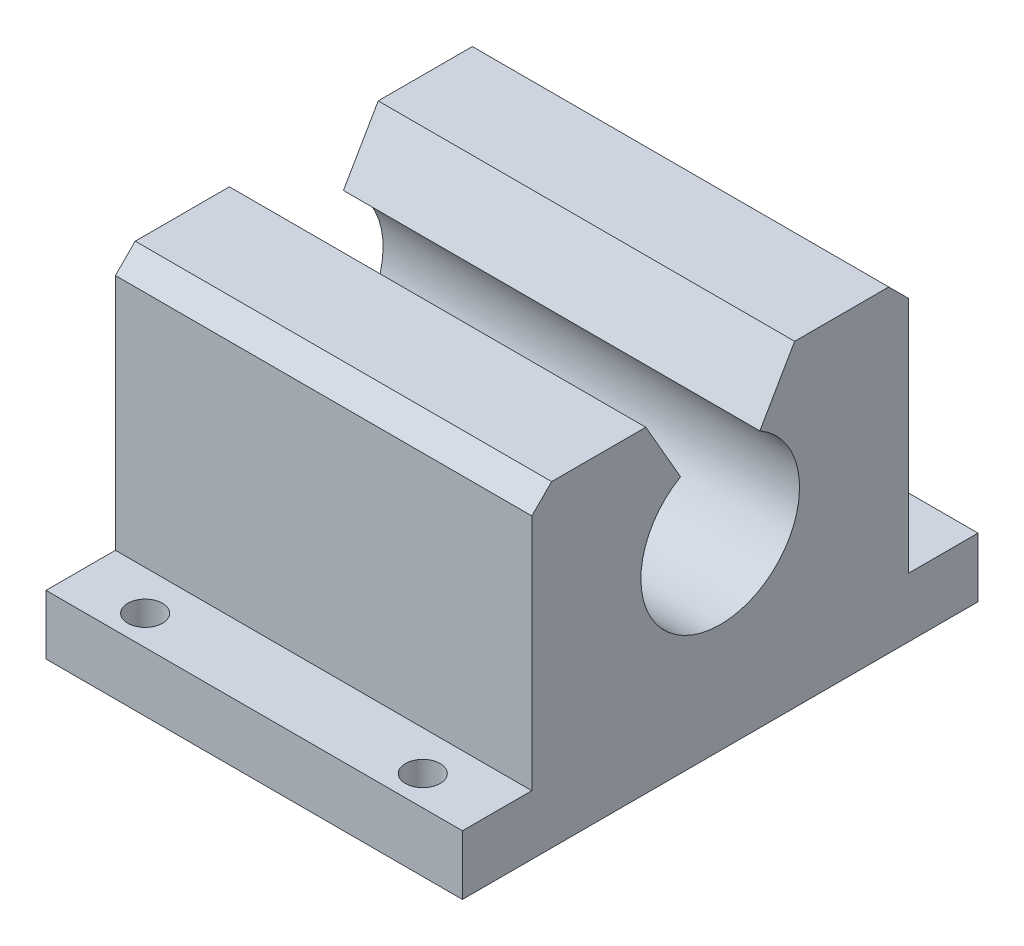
ISO-10303-21;
HEADER;
FILE_DESCRIPTION(('STEP AP214'),'2;1');
FILE_NAME('part.step','',(''),(''),'','','');
FILE_SCHEMA(('AUTOMOTIVE_DESIGN { 1 0 10303 214 1 1 1 1 }'));
ENDSEC;
DATA;
#1=APPLICATION_CONTEXT('core data for automotive mechanical design processes');
#2=APPLICATION_PROTOCOL_DEFINITION('international standard','automotive_design',2000,#1);
#3=PRODUCT_CONTEXT('',#1,'mechanical');
#4=PRODUCT('Part','Part','',(#3));
#5=PRODUCT_RELATED_PRODUCT_CATEGORY('part','',(#4));
#6=PRODUCT_DEFINITION_FORMATION('','',#4);
#7=PRODUCT_DEFINITION_CONTEXT('part definition',#1,'design');
#8=PRODUCT_DEFINITION('design','',#6,#7);
#9=PRODUCT_DEFINITION_SHAPE('','',#8);
#10=(LENGTH_UNIT() NAMED_UNIT(*) SI_UNIT(.MILLI.,.METRE.));
#11=(NAMED_UNIT(*) PLANE_ANGLE_UNIT() SI_UNIT($,.RADIAN.));
#12=(NAMED_UNIT(*) SI_UNIT($,.STERADIAN.) SOLID_ANGLE_UNIT());
#13=UNCERTAINTY_MEASURE_WITH_UNIT(LENGTH_MEASURE(1.E-05),#10,'distance_accuracy_value','');
#14=(GEOMETRIC_REPRESENTATION_CONTEXT(3) GLOBAL_UNCERTAINTY_ASSIGNED_CONTEXT((#13)) GLOBAL_UNIT_ASSIGNED_CONTEXT((#10,
#11,#12)) REPRESENTATION_CONTEXT('',''));
#15=CARTESIAN_POINT('',(0.,0.,0.));
#16=DIRECTION('',(0.,0.,1.));
#17=DIRECTION('',(1.,0.,0.));
#18=AXIS2_PLACEMENT_3D('',#15,#16,#17);
#19=CARTESIAN_POINT('',(66.675,50.8,30.1625));
#20=DIRECTION('',(0.,1.,0.));
#21=DIRECTION('',(0.,0.,1.));
#22=AXIS2_PLACEMENT_3D('',#19,#20,#21);
#23=PLANE('',#22);
#24=DIRECTION('',(0.,0.,-1.));
#25=VECTOR('',#24,1.);
#26=CARTESIAN_POINT('',(66.675,50.8,30.1625));
#27=LINE('',#26,#25);
#28=CARTESIAN_POINT('',(66.675,50.8,-11.9150661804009));
#29=VERTEX_POINT('',#28);
#30=CARTESIAN_POINT('',(66.675,50.8,-26.9874999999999));
#31=VERTEX_POINT('',#30);
#32=EDGE_CURVE('E146',#29,#31,#27,.T.);
#33=ORIENTED_EDGE('',*,*,#32,.T.);
#34=DIRECTION('',(-1.,0.,0.));
#35=VECTOR('',#34,1.);
#36=CARTESIAN_POINT('',(0.,50.8,-26.9874999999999));
#37=LINE('',#36,#35);
#38=CARTESIAN_POINT('',(0.,50.8,-26.9874999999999));
#39=VERTEX_POINT('',#38);
#40=EDGE_CURVE('E38',#31,#39,#37,.T.);
#41=ORIENTED_EDGE('',*,*,#40,.T.);
#42=DIRECTION('',(0.,0.,-1.));
#43=VECTOR('',#42,1.);
#44=CARTESIAN_POINT('',(0.,50.8,30.1625));
#45=LINE('',#44,#43);
#46=CARTESIAN_POINT('',(0.,50.8,-11.9150661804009));
#47=VERTEX_POINT('',#46);
#48=EDGE_CURVE('E149',#47,#39,#45,.T.);
#49=ORIENTED_EDGE('',*,*,#48,.F.);
#50=DIRECTION('',(1.,0.,0.));
#51=VECTOR('',#50,1.);
#52=CARTESIAN_POINT('',(0.,50.8,-11.9150661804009));
#53=LINE('',#52,#51);
#54=EDGE_CURVE('E134',#47,#29,#53,.T.);
#55=ORIENTED_EDGE('',*,*,#54,.T.);
#56=EDGE_LOOP('',(#33,#41,#49,#55));
#57=FACE_BOUND('',#56,.T.);
#58=ADVANCED_FACE('F30',(#57),#23,.T.);
#59=CARTESIAN_POINT('',(66.675,50.8,-41.275));
#60=DIRECTION('',(-1.,0.,0.));
#61=DIRECTION('',(0.,0.,1.));
#62=AXIS2_PLACEMENT_3D('',#59,#60,#61);
#63=PLANE('',#62);
#64=CARTESIAN_POINT('',(66.675,50.8,26.9875));
#65=VERTEX_POINT('',#64);
#66=CARTESIAN_POINT('',(66.675,50.8,11.9150661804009));
#67=VERTEX_POINT('',#66);
#68=EDGE_CURVE('E155',#65,#67,#27,.T.);
#69=ORIENTED_EDGE('',*,*,#68,.F.);
#70=DIRECTION('',(0.,0.707106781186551,-0.707106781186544));
#71=VECTOR('',#70,1.);
#72=CARTESIAN_POINT('',(66.675,47.6249999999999,30.1625));
#73=LINE('',#72,#71);
#74=CARTESIAN_POINT('',(66.675,47.6249999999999,30.1625));
#75=VERTEX_POINT('',#74);
#76=EDGE_CURVE('E201',#65,#75,#73,.F.);
#77=ORIENTED_EDGE('',*,*,#76,.T.);
#78=DIRECTION('',(0.,1.,0.));
#79=VECTOR('',#78,1.);
#80=CARTESIAN_POINT('',(66.675,9.525,30.1625));
#81=LINE('',#80,#79);
#82=CARTESIAN_POINT('',(66.675,9.525,30.1625));
#83=VERTEX_POINT('',#82);
#84=EDGE_CURVE('E158',#83,#75,#81,.T.);
#85=ORIENTED_EDGE('',*,*,#84,.F.);
#86=DIRECTION('',(0.,0.,-1.));
#87=VECTOR('',#86,1.);
#88=CARTESIAN_POINT('',(66.675,9.525,41.275));
#89=LINE('',#88,#87);
#90=CARTESIAN_POINT('',(66.675,9.525,41.275));
#91=VERTEX_POINT('',#90);
#92=EDGE_CURVE('E165',#91,#83,#89,.T.);
#93=ORIENTED_EDGE('',*,*,#92,.F.);
#94=DIRECTION('',(0.,1.,0.));
#95=VECTOR('',#94,1.);
#96=CARTESIAN_POINT('',(66.675,0.,41.275));
#97=LINE('',#96,#95);
#98=CARTESIAN_POINT('',(66.675,0.,41.275));
#99=VERTEX_POINT('',#98);
#100=EDGE_CURVE('E168',#99,#91,#97,.T.);
#101=ORIENTED_EDGE('',*,*,#100,.F.);
#102=DIRECTION('',(0.,0.,-1.));
#103=VECTOR('',#102,1.);
#104=CARTESIAN_POINT('',(66.675,0.,41.275));
#105=LINE('',#104,#103);
#106=CARTESIAN_POINT('',(66.675,0.,-41.275));
#107=VERTEX_POINT('',#106);
#108=EDGE_CURVE('E171',#99,#107,#105,.T.);
#109=ORIENTED_EDGE('',*,*,#108,.T.);
#110=DIRECTION('',(0.,1.,0.));
#111=VECTOR('',#110,1.);
#112=CARTESIAN_POINT('',(66.675,0.,-41.275));
#113=LINE('',#112,#111);
#114=CARTESIAN_POINT('',(66.675,9.525,-41.275));
#115=VERTEX_POINT('',#114);
#116=EDGE_CURVE('E225',#107,#115,#113,.T.);
#117=ORIENTED_EDGE('',*,*,#116,.T.);
#118=DIRECTION('',(0.,0.,1.));
#119=VECTOR('',#118,1.);
#120=CARTESIAN_POINT('',(66.675,9.525,-41.275));
#121=LINE('',#120,#119);
#122=CARTESIAN_POINT('',(66.675,9.525,-30.1625));
#123=VERTEX_POINT('',#122);
#124=EDGE_CURVE('E159',#115,#123,#121,.T.);
#125=ORIENTED_EDGE('',*,*,#124,.T.);
#126=DIRECTION('',(0.,1.,0.));
#127=VECTOR('',#126,1.);
#128=CARTESIAN_POINT('',(66.675,9.525,-30.1625));
#129=LINE('',#128,#127);
#130=CARTESIAN_POINT('',(66.675,47.625,-30.1625));
#131=VERTEX_POINT('',#130);
#132=EDGE_CURVE('E156',#123,#131,#129,.T.);
#133=ORIENTED_EDGE('',*,*,#132,.T.);
#134=DIRECTION('',(0.,0.707106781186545,0.707106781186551));
#135=VECTOR('',#134,1.);
#136=CARTESIAN_POINT('',(66.675,50.8,-26.9874999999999));
#137=LINE('',#136,#135);
#138=EDGE_CURVE('E45',#131,#31,#137,.T.);
#139=ORIENTED_EDGE('',*,*,#138,.T.);
#140=ORIENTED_EDGE('',*,*,#32,.F.);
#141=DIRECTION('',(0.,-0.866025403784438,0.500000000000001));
#142=VECTOR('',#141,1.);
#143=CARTESIAN_POINT('',(66.675,50.8,-11.9150661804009));
#144=LINE('',#143,#142);
#145=CARTESIAN_POINT('',(66.675,41.1610226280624,-6.35000000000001));
#146=VERTEX_POINT('',#145);
#147=EDGE_CURVE('E131',#29,#146,#144,.T.);
#148=ORIENTED_EDGE('',*,*,#147,.T.);
#149=CARTESIAN_POINT('',(66.675,30.1625,0.));
#150=DIRECTION('',(1.,0.,0.));
#151=DIRECTION('',(0.,0.,-1.));
#152=AXIS2_PLACEMENT_3D('',#149,#150,#151);
#153=CIRCLE('',#152,12.7);
#154=CARTESIAN_POINT('',(66.675,41.1610226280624,6.35000000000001));
#155=VERTEX_POINT('',#154);
#156=EDGE_CURVE('E382',#155,#146,#153,.T.);
#157=ORIENTED_EDGE('',*,*,#156,.F.);
#158=DIRECTION('',(0.,-0.866025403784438,-0.500000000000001));
#159=VECTOR('',#158,1.);
#160=CARTESIAN_POINT('',(66.675,50.8,11.9150661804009));
#161=LINE('',#160,#159);
#162=EDGE_CURVE('E141',#67,#155,#161,.T.);
#163=ORIENTED_EDGE('',*,*,#162,.F.);
#164=EDGE_LOOP('',(#69,#77,#85,#93,#101,#109,#117,#125,#133,#139,#140,#148,#157,#163));
#165=FACE_BOUND('',#164,.T.);
#166=ADVANCED_FACE('F154',(#165),#63,.F.);
#167=CARTESIAN_POINT('',(0.,50.8,-41.275));
#168=DIRECTION('',(-1.,0.,0.));
#169=DIRECTION('',(0.,0.,1.));
#170=AXIS2_PLACEMENT_3D('',#167,#168,#169);
#171=PLANE('',#170);
#172=DIRECTION('',(0.,1.,0.));
#173=VECTOR('',#172,1.);
#174=CARTESIAN_POINT('',(0.,9.525,30.1625));
#175=LINE('',#174,#173);
#176=CARTESIAN_POINT('',(0.,9.525,30.1625));
#177=VERTEX_POINT('',#176);
#178=CARTESIAN_POINT('',(0.,47.6249999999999,30.1625));
#179=VERTEX_POINT('',#178);
#180=EDGE_CURVE('E211',#177,#179,#175,.T.);
#181=ORIENTED_EDGE('',*,*,#180,.T.);
#182=DIRECTION('',(0.,-0.707106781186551,0.707106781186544));
#183=VECTOR('',#182,1.);
#184=CARTESIAN_POINT('',(0.,84.93125,-7.14374999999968));
#185=LINE('',#184,#183);
#186=CARTESIAN_POINT('',(0.,50.8,26.9875));
#187=VERTEX_POINT('',#186);
#188=EDGE_CURVE('E196',#179,#187,#185,.F.);
#189=ORIENTED_EDGE('',*,*,#188,.T.);
#190=CARTESIAN_POINT('',(0.,50.8,11.9150661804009));
#191=VERTEX_POINT('',#190);
#192=EDGE_CURVE('E208',#187,#191,#45,.T.);
#193=ORIENTED_EDGE('',*,*,#192,.T.);
#194=DIRECTION('',(0.,-0.866025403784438,-0.500000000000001));
#195=VECTOR('',#194,1.);
#196=CARTESIAN_POINT('',(0.,50.8,11.9150661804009));
#197=LINE('',#196,#195);
#198=CARTESIAN_POINT('',(0.,41.1610226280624,6.35000000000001));
#199=VERTEX_POINT('',#198);
#200=EDGE_CURVE('E140',#191,#199,#197,.T.);
#201=ORIENTED_EDGE('',*,*,#200,.T.);
#202=CARTESIAN_POINT('',(0.,30.1625,0.));
#203=DIRECTION('',(1.,0.,0.));
#204=DIRECTION('',(0.,0.,-1.));
#205=AXIS2_PLACEMENT_3D('',#202,#203,#204);
#206=CIRCLE('',#205,12.7);
#207=CARTESIAN_POINT('',(0.,41.1610226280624,-6.35000000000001));
#208=VERTEX_POINT('',#207);
#209=EDGE_CURVE('E384',#199,#208,#206,.T.);
#210=ORIENTED_EDGE('',*,*,#209,.T.);
#211=DIRECTION('',(0.,-0.866025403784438,0.500000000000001));
#212=VECTOR('',#211,1.);
#213=CARTESIAN_POINT('',(0.,50.8,-11.9150661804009));
#214=LINE('',#213,#212);
#215=EDGE_CURVE('E151',#47,#208,#214,.T.);
#216=ORIENTED_EDGE('',*,*,#215,.F.);
#217=ORIENTED_EDGE('',*,*,#48,.T.);
#218=DIRECTION('',(0.,-0.707106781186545,-0.707106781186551));
#219=VECTOR('',#218,1.);
#220=CARTESIAN_POINT('',(0.,43.65625,-34.13125));
#221=LINE('',#220,#219);
#222=CARTESIAN_POINT('',(0.,47.625,-30.1625));
#223=VERTEX_POINT('',#222);
#224=EDGE_CURVE('E194',#39,#223,#221,.T.);
#225=ORIENTED_EDGE('',*,*,#224,.T.);
#226=DIRECTION('',(0.,1.,0.));
#227=VECTOR('',#226,1.);
#228=CARTESIAN_POINT('',(0.,9.525,-30.1625));
#229=LINE('',#228,#227);
#230=CARTESIAN_POINT('',(0.,9.525,-30.1625));
#231=VERTEX_POINT('',#230);
#232=EDGE_CURVE('E209',#231,#223,#229,.T.);
#233=ORIENTED_EDGE('',*,*,#232,.F.);
#234=DIRECTION('',(0.,0.,1.));
#235=VECTOR('',#234,1.);
#236=CARTESIAN_POINT('',(0.,9.525,-41.275));
#237=LINE('',#236,#235);
#238=CARTESIAN_POINT('',(0.,9.525,-41.275));
#239=VERTEX_POINT('',#238);
#240=EDGE_CURVE('E212',#239,#231,#237,.T.);
#241=ORIENTED_EDGE('',*,*,#240,.F.);
#242=DIRECTION('',(0.,1.,0.));
#243=VECTOR('',#242,1.);
#244=CARTESIAN_POINT('',(0.,0.,-41.275));
#245=LINE('',#244,#243);
#246=CARTESIAN_POINT('',(0.,0.,-41.275));
#247=VERTEX_POINT('',#246);
#248=EDGE_CURVE('E379',#247,#239,#245,.T.);
#249=ORIENTED_EDGE('',*,*,#248,.F.);
#250=DIRECTION('',(0.,0.,-1.));
#251=VECTOR('',#250,1.);
#252=CARTESIAN_POINT('',(0.,0.,41.275));
#253=LINE('',#252,#251);
#254=CARTESIAN_POINT('',(0.,0.,41.275));
#255=VERTEX_POINT('',#254);
#256=EDGE_CURVE('E223',#255,#247,#253,.T.);
#257=ORIENTED_EDGE('',*,*,#256,.F.);
#258=DIRECTION('',(0.,1.,0.));
#259=VECTOR('',#258,1.);
#260=CARTESIAN_POINT('',(0.,0.,41.275));
#261=LINE('',#260,#259);
#262=CARTESIAN_POINT('',(0.,9.525,41.275));
#263=VERTEX_POINT('',#262);
#264=EDGE_CURVE('E220',#255,#263,#261,.T.);
#265=ORIENTED_EDGE('',*,*,#264,.T.);
#266=DIRECTION('',(0.,0.,-1.));
#267=VECTOR('',#266,1.);
#268=CARTESIAN_POINT('',(0.,9.525,41.275));
#269=LINE('',#268,#267);
#270=EDGE_CURVE('E217',#263,#177,#269,.T.);
#271=ORIENTED_EDGE('',*,*,#270,.T.);
#272=EDGE_LOOP('',(#181,#189,#193,#201,#210,#216,#217,#225,#233,#241,#249,#257,#265,#271));
#273=FACE_BOUND('',#272,.T.);
#274=ADVANCED_FACE('F205',(#273),#171,.T.);
#275=CARTESIAN_POINT('',(66.675,0.,-41.275));
#276=DIRECTION('',(0.,0.,1.));
#277=DIRECTION('',(1.,0.,0.));
#278=AXIS2_PLACEMENT_3D('',#275,#276,#277);
#279=PLANE('',#278);
#280=ORIENTED_EDGE('',*,*,#248,.T.);
#281=DIRECTION('',(-1.,0.,0.));
#282=VECTOR('',#281,1.);
#283=CARTESIAN_POINT('',(66.675,9.525,-41.275));
#284=LINE('',#283,#282);
#285=EDGE_CURVE('E185',#115,#239,#284,.T.);
#286=ORIENTED_EDGE('',*,*,#285,.F.);
#287=ORIENTED_EDGE('',*,*,#116,.F.);
#288=DIRECTION('',(-1.,0.,0.));
#289=VECTOR('',#288,1.);
#290=CARTESIAN_POINT('',(66.675,0.,-41.275));
#291=LINE('',#290,#289);
#292=EDGE_CURVE('E173',#107,#247,#291,.T.);
#293=ORIENTED_EDGE('',*,*,#292,.T.);
#294=EDGE_LOOP('',(#280,#286,#287,#293));
#295=FACE_BOUND('',#294,.T.);
#296=ADVANCED_FACE('F32',(#295),#279,.F.);
#297=CARTESIAN_POINT('',(66.675,9.525,-41.275));
#298=DIRECTION('',(0.,-1.,0.));
#299=DIRECTION('',(0.,0.,-1.));
#300=AXIS2_PLACEMENT_3D('',#297,#298,#299);
#301=PLANE('',#300);
#302=CARTESIAN_POINT('',(11.1125,9.525,-36.5125));
#303=DIRECTION('',(0.,1.,0.));
#304=DIRECTION('',(0.,0.,1.));
#305=AXIS2_PLACEMENT_3D('',#302,#303,#304);
#306=CIRCLE('',#305,2.778125);
#307=CARTESIAN_POINT('',(11.1125,9.525,-33.734375));
#308=VERTEX_POINT('',#307);
#309=EDGE_CURVE('E409',#308,#308,#306,.T.);
#310=ORIENTED_EDGE('',*,*,#309,.F.);
#311=EDGE_LOOP('',(#310));
#312=FACE_BOUND('',#311,.T.);
#313=CARTESIAN_POINT('',(55.5625,9.525,-36.5125));
#314=DIRECTION('',(0.,1.,0.));
#315=DIRECTION('',(0.,0.,1.));
#316=AXIS2_PLACEMENT_3D('',#313,#314,#315);
#317=CIRCLE('',#316,2.778125);
#318=CARTESIAN_POINT('',(55.5625,9.525,-33.734375));
#319=VERTEX_POINT('',#318);
#320=EDGE_CURVE('E397',#319,#319,#317,.T.);
#321=ORIENTED_EDGE('',*,*,#320,.F.);
#322=EDGE_LOOP('',(#321));
#323=FACE_BOUND('',#322,.T.);
#324=ORIENTED_EDGE('',*,*,#240,.T.);
#325=DIRECTION('',(-1.,0.,0.));
#326=VECTOR('',#325,1.);
#327=CARTESIAN_POINT('',(66.675,9.525,-30.1625));
#328=LINE('',#327,#326);
#329=EDGE_CURVE('E182',#123,#231,#328,.T.);
#330=ORIENTED_EDGE('',*,*,#329,.F.);
#331=ORIENTED_EDGE('',*,*,#124,.F.);
#332=ORIENTED_EDGE('',*,*,#285,.T.);
#333=EDGE_LOOP('',(#324,#330,#331,#332));
#334=FACE_BOUND('',#333,.T.);
#335=ADVANCED_FACE('F231',(#312,#323,#334),#301,.F.);
#336=CARTESIAN_POINT('',(66.675,9.525,-30.1625));
#337=DIRECTION('',(0.,0.,1.));
#338=DIRECTION('',(1.,0.,0.));
#339=AXIS2_PLACEMENT_3D('',#336,#337,#338);
#340=PLANE('',#339);
#341=ORIENTED_EDGE('',*,*,#232,.T.);
#342=DIRECTION('',(1.,0.,0.));
#343=VECTOR('',#342,1.);
#344=CARTESIAN_POINT('',(66.675,47.625,-30.1625));
#345=LINE('',#344,#343);
#346=EDGE_CURVE('E11',#223,#131,#345,.T.);
#347=ORIENTED_EDGE('',*,*,#346,.T.);
#348=ORIENTED_EDGE('',*,*,#132,.F.);
#349=ORIENTED_EDGE('',*,*,#329,.T.);
#350=EDGE_LOOP('',(#341,#347,#348,#349));
#351=FACE_BOUND('',#350,.T.);
#352=ADVANCED_FACE('F232',(#351),#340,.F.);
#353=ORIENTED_EDGE('',*,*,#192,.F.);
#354=DIRECTION('',(1.,0.,0.));
#355=VECTOR('',#354,1.);
#356=CARTESIAN_POINT('',(66.675,50.8,26.9875));
#357=LINE('',#356,#355);
#358=EDGE_CURVE('E198',#187,#65,#357,.T.);
#359=ORIENTED_EDGE('',*,*,#358,.T.);
#360=ORIENTED_EDGE('',*,*,#68,.T.);
#361=DIRECTION('',(1.,0.,0.));
#362=VECTOR('',#361,1.);
#363=CARTESIAN_POINT('',(0.,50.8,11.9150661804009));
#364=LINE('',#363,#362);
#365=EDGE_CURVE('E150',#191,#67,#364,.T.);
#366=ORIENTED_EDGE('',*,*,#365,.F.);
#367=EDGE_LOOP('',(#353,#359,#360,#366));
#368=FACE_BOUND('',#367,.T.);
#369=ADVANCED_FACE('F234',(#368),#23,.T.);
#370=CARTESIAN_POINT('',(66.675,9.525,30.1625));
#371=DIRECTION('',(0.,0.,1.));
#372=DIRECTION('',(1.,0.,0.));
#373=AXIS2_PLACEMENT_3D('',#370,#371,#372);
#374=PLANE('',#373);
#375=ORIENTED_EDGE('',*,*,#84,.T.);
#376=DIRECTION('',(-1.,0.,0.));
#377=VECTOR('',#376,1.);
#378=CARTESIAN_POINT('',(66.675,47.6249999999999,30.1625));
#379=LINE('',#378,#377);
#380=EDGE_CURVE('E191',#75,#179,#379,.T.);
#381=ORIENTED_EDGE('',*,*,#380,.T.);
#382=ORIENTED_EDGE('',*,*,#180,.F.);
#383=DIRECTION('',(-1.,0.,0.));
#384=VECTOR('',#383,1.);
#385=CARTESIAN_POINT('',(66.675,9.525,30.1625));
#386=LINE('',#385,#384);
#387=EDGE_CURVE('E180',#83,#177,#386,.T.);
#388=ORIENTED_EDGE('',*,*,#387,.F.);
#389=EDGE_LOOP('',(#375,#381,#382,#388));
#390=FACE_BOUND('',#389,.T.);
#391=ADVANCED_FACE('F240',(#390),#374,.T.);
#392=CARTESIAN_POINT('',(66.675,9.525,41.275));
#393=DIRECTION('',(0.,1.,0.));
#394=DIRECTION('',(0.,0.,1.));
#395=AXIS2_PLACEMENT_3D('',#392,#393,#394);
#396=PLANE('',#395);
#397=CARTESIAN_POINT('',(11.1125,9.525,36.5125));
#398=DIRECTION('',(0.,1.,0.));
#399=DIRECTION('',(0.,0.,1.));
#400=AXIS2_PLACEMENT_3D('',#397,#398,#399);
#401=CIRCLE('',#400,2.778125);
#402=CARTESIAN_POINT('',(11.1125,9.525,39.290625));
#403=VERTEX_POINT('',#402);
#404=EDGE_CURVE('E403',#403,#403,#401,.T.);
#405=ORIENTED_EDGE('',*,*,#404,.F.);
#406=EDGE_LOOP('',(#405));
#407=FACE_BOUND('',#406,.T.);
#408=CARTESIAN_POINT('',(55.5625,9.525,36.5125));
#409=DIRECTION('',(0.,1.,0.));
#410=DIRECTION('',(0.,0.,1.));
#411=AXIS2_PLACEMENT_3D('',#408,#409,#410);
#412=CIRCLE('',#411,2.778125);
#413=CARTESIAN_POINT('',(55.5625,9.525,39.290625));
#414=VERTEX_POINT('',#413);
#415=EDGE_CURVE('E391',#414,#414,#412,.T.);
#416=ORIENTED_EDGE('',*,*,#415,.F.);
#417=EDGE_LOOP('',(#416));
#418=FACE_BOUND('',#417,.T.);
#419=ORIENTED_EDGE('',*,*,#270,.F.);
#420=DIRECTION('',(-1.,0.,0.));
#421=VECTOR('',#420,1.);
#422=CARTESIAN_POINT('',(66.675,9.525,41.275));
#423=LINE('',#422,#421);
#424=EDGE_CURVE('E178',#91,#263,#423,.T.);
#425=ORIENTED_EDGE('',*,*,#424,.F.);
#426=ORIENTED_EDGE('',*,*,#92,.T.);
#427=ORIENTED_EDGE('',*,*,#387,.T.);
#428=EDGE_LOOP('',(#419,#425,#426,#427));
#429=FACE_BOUND('',#428,.T.);
#430=ADVANCED_FACE('F254',(#407,#418,#429),#396,.T.);
#431=CARTESIAN_POINT('',(66.675,0.,41.275));
#432=DIRECTION('',(0.,0.,1.));
#433=DIRECTION('',(1.,0.,0.));
#434=AXIS2_PLACEMENT_3D('',#431,#432,#433);
#435=PLANE('',#434);
#436=ORIENTED_EDGE('',*,*,#264,.F.);
#437=DIRECTION('',(-1.,0.,0.));
#438=VECTOR('',#437,1.);
#439=CARTESIAN_POINT('',(66.675,0.,41.275));
#440=LINE('',#439,#438);
#441=EDGE_CURVE('E176',#99,#255,#440,.T.);
#442=ORIENTED_EDGE('',*,*,#441,.F.);
#443=ORIENTED_EDGE('',*,*,#100,.T.);
#444=ORIENTED_EDGE('',*,*,#424,.T.);
#445=EDGE_LOOP('',(#436,#442,#443,#444));
#446=FACE_BOUND('',#445,.T.);
#447=ADVANCED_FACE('F258',(#446),#435,.T.);
#448=CARTESIAN_POINT('',(66.675,0.,41.275));
#449=DIRECTION('',(0.,1.,0.));
#450=DIRECTION('',(0.,0.,1.));
#451=AXIS2_PLACEMENT_3D('',#448,#449,#450);
#452=PLANE('',#451);
#453=CARTESIAN_POINT('',(11.1125,0.,-36.5125));
#454=DIRECTION('',(0.,1.,0.));
#455=DIRECTION('',(0.,0.,1.));
#456=AXIS2_PLACEMENT_3D('',#453,#454,#455);
#457=CIRCLE('',#456,2.778125);
#458=CARTESIAN_POINT('',(11.1125,0.,-33.734375));
#459=VERTEX_POINT('',#458);
#460=EDGE_CURVE('E406',#459,#459,#457,.T.);
#461=ORIENTED_EDGE('',*,*,#460,.T.);
#462=EDGE_LOOP('',(#461));
#463=FACE_BOUND('',#462,.T.);
#464=CARTESIAN_POINT('',(11.1125,0.,36.5125));
#465=DIRECTION('',(0.,1.,0.));
#466=DIRECTION('',(0.,0.,1.));
#467=AXIS2_PLACEMENT_3D('',#464,#465,#466);
#468=CIRCLE('',#467,2.778125);
#469=CARTESIAN_POINT('',(11.1125,0.,39.290625));
#470=VERTEX_POINT('',#469);
#471=EDGE_CURVE('E400',#470,#470,#468,.T.);
#472=ORIENTED_EDGE('',*,*,#471,.T.);
#473=EDGE_LOOP('',(#472));
#474=FACE_BOUND('',#473,.T.);
#475=CARTESIAN_POINT('',(55.5625,0.,-36.5125));
#476=DIRECTION('',(0.,1.,0.));
#477=DIRECTION('',(0.,0.,1.));
#478=AXIS2_PLACEMENT_3D('',#475,#476,#477);
#479=CIRCLE('',#478,2.778125);
#480=CARTESIAN_POINT('',(55.5625,0.,-33.734375));
#481=VERTEX_POINT('',#480);
#482=EDGE_CURVE('E394',#481,#481,#479,.T.);
#483=ORIENTED_EDGE('',*,*,#482,.T.);
#484=EDGE_LOOP('',(#483));
#485=FACE_BOUND('',#484,.T.);
#486=CARTESIAN_POINT('',(55.5625,0.,36.5125));
#487=DIRECTION('',(0.,1.,0.));
#488=DIRECTION('',(0.,0.,1.));
#489=AXIS2_PLACEMENT_3D('',#486,#487,#488);
#490=CIRCLE('',#489,2.778125);
#491=CARTESIAN_POINT('',(55.5625,0.,39.290625));
#492=VERTEX_POINT('',#491);
#493=EDGE_CURVE('E388',#492,#492,#490,.T.);
#494=ORIENTED_EDGE('',*,*,#493,.T.);
#495=EDGE_LOOP('',(#494));
#496=FACE_BOUND('',#495,.T.);
#497=ORIENTED_EDGE('',*,*,#256,.T.);
#498=ORIENTED_EDGE('',*,*,#292,.F.);
#499=ORIENTED_EDGE('',*,*,#108,.F.);
#500=ORIENTED_EDGE('',*,*,#441,.T.);
#501=EDGE_LOOP('',(#497,#498,#499,#500));
#502=FACE_BOUND('',#501,.T.);
#503=ADVANCED_FACE('F262',(#463,#474,#485,#496,#502),#452,.F.);
#504=CARTESIAN_POINT('',(66.675,30.1625,0.));
#505=DIRECTION('',(-1.,0.,0.));
#506=DIRECTION('',(0.,0.,1.));
#507=AXIS2_PLACEMENT_3D('',#504,#505,#506);
#508=CYLINDRICAL_SURFACE('',#507,12.7);
#509=DIRECTION('',(-1.,0.,0.));
#510=VECTOR('',#509,1.);
#511=CARTESIAN_POINT('',(66.675,41.1610226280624,6.35000000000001));
#512=LINE('',#511,#510);
#513=EDGE_CURVE('E189',#155,#199,#512,.T.);
#514=ORIENTED_EDGE('',*,*,#513,.F.);
#515=ORIENTED_EDGE('',*,*,#156,.T.);
#516=DIRECTION('',(-1.,0.,0.));
#517=VECTOR('',#516,1.);
#518=CARTESIAN_POINT('',(66.675,41.1610226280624,-6.35000000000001));
#519=LINE('',#518,#517);
#520=EDGE_CURVE('E137',#146,#208,#519,.T.);
#521=ORIENTED_EDGE('',*,*,#520,.T.);
#522=ORIENTED_EDGE('',*,*,#209,.F.);
#523=EDGE_LOOP('',(#514,#515,#521,#522));
#524=FACE_BOUND('',#523,.T.);
#525=ADVANCED_FACE('F265',(#524),#508,.F.);
#526=CARTESIAN_POINT('',(55.5625,0.,36.5125));
#527=DIRECTION('',(0.,1.,0.));
#528=DIRECTION('',(0.,0.,1.));
#529=AXIS2_PLACEMENT_3D('',#526,#527,#528);
#530=CYLINDRICAL_SURFACE('',#529,2.778125);
#531=ORIENTED_EDGE('',*,*,#493,.F.);
#532=EDGE_LOOP('',(#531));
#533=FACE_BOUND('',#532,.T.);
#534=ORIENTED_EDGE('',*,*,#415,.T.);
#535=EDGE_LOOP('',(#534));
#536=FACE_BOUND('',#535,.T.);
#537=ADVANCED_FACE('F271',(#533,#536),#530,.F.);
#538=CARTESIAN_POINT('',(55.5625,0.,-36.5125));
#539=DIRECTION('',(0.,1.,0.));
#540=DIRECTION('',(0.,0.,1.));
#541=AXIS2_PLACEMENT_3D('',#538,#539,#540);
#542=CYLINDRICAL_SURFACE('',#541,2.778125);
#543=ORIENTED_EDGE('',*,*,#482,.F.);
#544=EDGE_LOOP('',(#543));
#545=FACE_BOUND('',#544,.T.);
#546=ORIENTED_EDGE('',*,*,#320,.T.);
#547=EDGE_LOOP('',(#546));
#548=FACE_BOUND('',#547,.T.);
#549=ADVANCED_FACE('F275',(#545,#548),#542,.F.);
#550=CARTESIAN_POINT('',(11.1125,0.,36.5125));
#551=DIRECTION('',(0.,1.,0.));
#552=DIRECTION('',(0.,0.,1.));
#553=AXIS2_PLACEMENT_3D('',#550,#551,#552);
#554=CYLINDRICAL_SURFACE('',#553,2.778125);
#555=ORIENTED_EDGE('',*,*,#471,.F.);
#556=EDGE_LOOP('',(#555));
#557=FACE_BOUND('',#556,.T.);
#558=ORIENTED_EDGE('',*,*,#404,.T.);
#559=EDGE_LOOP('',(#558));
#560=FACE_BOUND('',#559,.T.);
#561=ADVANCED_FACE('F279',(#557,#560),#554,.F.);
#562=CARTESIAN_POINT('',(11.1125,0.,-36.5125));
#563=DIRECTION('',(0.,1.,0.));
#564=DIRECTION('',(0.,0.,1.));
#565=AXIS2_PLACEMENT_3D('',#562,#563,#564);
#566=CYLINDRICAL_SURFACE('',#565,2.778125);
#567=ORIENTED_EDGE('',*,*,#460,.F.);
#568=EDGE_LOOP('',(#567));
#569=FACE_BOUND('',#568,.T.);
#570=ORIENTED_EDGE('',*,*,#309,.T.);
#571=EDGE_LOOP('',(#570));
#572=FACE_BOUND('',#571,.T.);
#573=ADVANCED_FACE('F283',(#569,#572),#566,.F.);
#574=CARTESIAN_POINT('',(0.,50.8,-11.9150661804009));
#575=DIRECTION('',(0.,0.500000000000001,0.866025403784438));
#576=DIRECTION('',(0.,-0.866025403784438,0.500000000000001));
#577=AXIS2_PLACEMENT_3D('',#574,#575,#576);
#578=PLANE('',#577);
#579=ORIENTED_EDGE('',*,*,#147,.F.);
#580=ORIENTED_EDGE('',*,*,#54,.F.);
#581=ORIENTED_EDGE('',*,*,#215,.T.);
#582=ORIENTED_EDGE('',*,*,#520,.F.);
#583=EDGE_LOOP('',(#579,#580,#581,#582));
#584=FACE_BOUND('',#583,.T.);
#585=ADVANCED_FACE('F133',(#584),#578,.T.);
#586=CARTESIAN_POINT('',(0.,50.8,11.9150661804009));
#587=DIRECTION('',(0.,-0.500000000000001,0.866025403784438));
#588=DIRECTION('',(0.,-0.866025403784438,-0.500000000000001));
#589=AXIS2_PLACEMENT_3D('',#586,#587,#588);
#590=PLANE('',#589);
#591=ORIENTED_EDGE('',*,*,#513,.T.);
#592=ORIENTED_EDGE('',*,*,#200,.F.);
#593=ORIENTED_EDGE('',*,*,#365,.T.);
#594=ORIENTED_EDGE('',*,*,#162,.T.);
#595=EDGE_LOOP('',(#591,#592,#593,#594));
#596=FACE_BOUND('',#595,.T.);
#597=ADVANCED_FACE('F288',(#596),#590,.F.);
#598=CARTESIAN_POINT('',(66.675,47.6249999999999,30.1625));
#599=DIRECTION('',(0.,-0.707106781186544,-0.707106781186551));
#600=DIRECTION('',(0.,0.707106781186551,-0.707106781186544));
#601=AXIS2_PLACEMENT_3D('',#598,#599,#600);
#602=PLANE('',#601);
#603=ORIENTED_EDGE('',*,*,#76,.F.);
#604=ORIENTED_EDGE('',*,*,#358,.F.);
#605=ORIENTED_EDGE('',*,*,#188,.F.);
#606=ORIENTED_EDGE('',*,*,#380,.F.);
#607=EDGE_LOOP('',(#603,#604,#605,#606));
#608=FACE_BOUND('',#607,.T.);
#609=ADVANCED_FACE('F290',(#608),#602,.F.);
#610=CARTESIAN_POINT('',(66.675,50.8,-26.9874999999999));
#611=DIRECTION('',(0.,0.707106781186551,-0.707106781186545));
#612=DIRECTION('',(0.,0.707106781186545,0.707106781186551));
#613=AXIS2_PLACEMENT_3D('',#610,#611,#612);
#614=PLANE('',#613);
#615=ORIENTED_EDGE('',*,*,#138,.F.);
#616=ORIENTED_EDGE('',*,*,#346,.F.);
#617=ORIENTED_EDGE('',*,*,#224,.F.);
#618=ORIENTED_EDGE('',*,*,#40,.F.);
#619=EDGE_LOOP('',(#615,#616,#617,#618));
#620=FACE_BOUND('',#619,.T.);
#621=ADVANCED_FACE('F296',(#620),#614,.T.);
#622=CLOSED_SHELL('',(#58,#166,#274,#296,#335,#352,#369,#391,#430,#447,#503,#525,#537,#549,#561,
#573,#585,#597,#609,#621));
#623=MANIFOLD_SOLID_BREP('B2',#622);
#624=ADVANCED_BREP_SHAPE_REPRESENTATION('',(#18,#623),#14);
#625=SHAPE_DEFINITION_REPRESENTATION(#9,#624);
ENDSEC;
END-ISO-10303-21;
